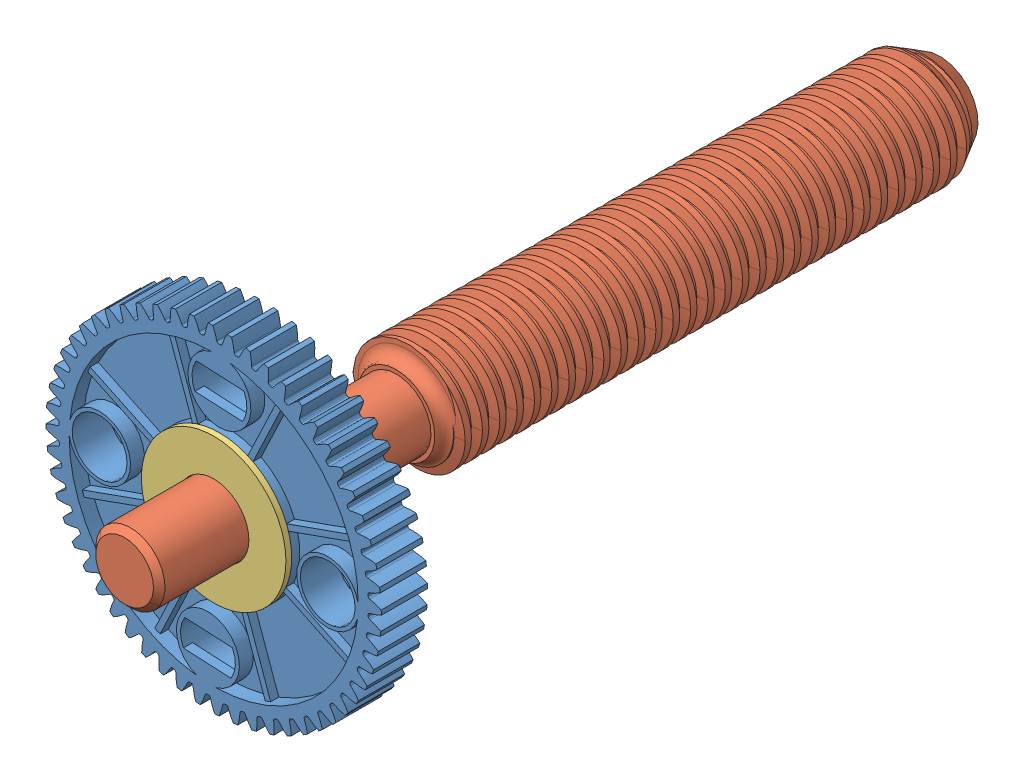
SolidWorks assembly CE5_Vis.sldasm, configuration Défaut (file format 9000). Lengths in mm.
Overall size (60.83 60.83 141).
5 component instances, 4 part files, 0 mates.
Components (placement in the parent):
- 70_R4-1: 70_R4.sldprt [Défaut] at (-30.4083 0.9476 -32.5519) x (0.998726 -0.050457 0) z (0 0 -1) size (57.97 57.97 15.72)
- 70_k-1: 70_k.sldprt [Défaut] at (-30.4083 0.9476 -17.1519) x (-0.998726 0.050457 0) z (0 0 -1) size (19.87 19 141)
- 70_f_2-1: 70_f_2.sldprt [Défaut] at (-30.4083 0.9476 -49.2719) size (25 25 1)
- 70_l-1: 70_l.sldprt [Défaut] at (-30.4083 0.9476 -36.1519) x (0.993582 -0.050197 0.101365) z (-0.101236 0.005115 0.994849) size (5 21.7 5)
- 70_f_2-2: 70_f_2.sldprt [Défaut] at (-30.4083 0.9476 -32.5519) x (1 0 0) z (0 0 -1) size (25 25 1)
